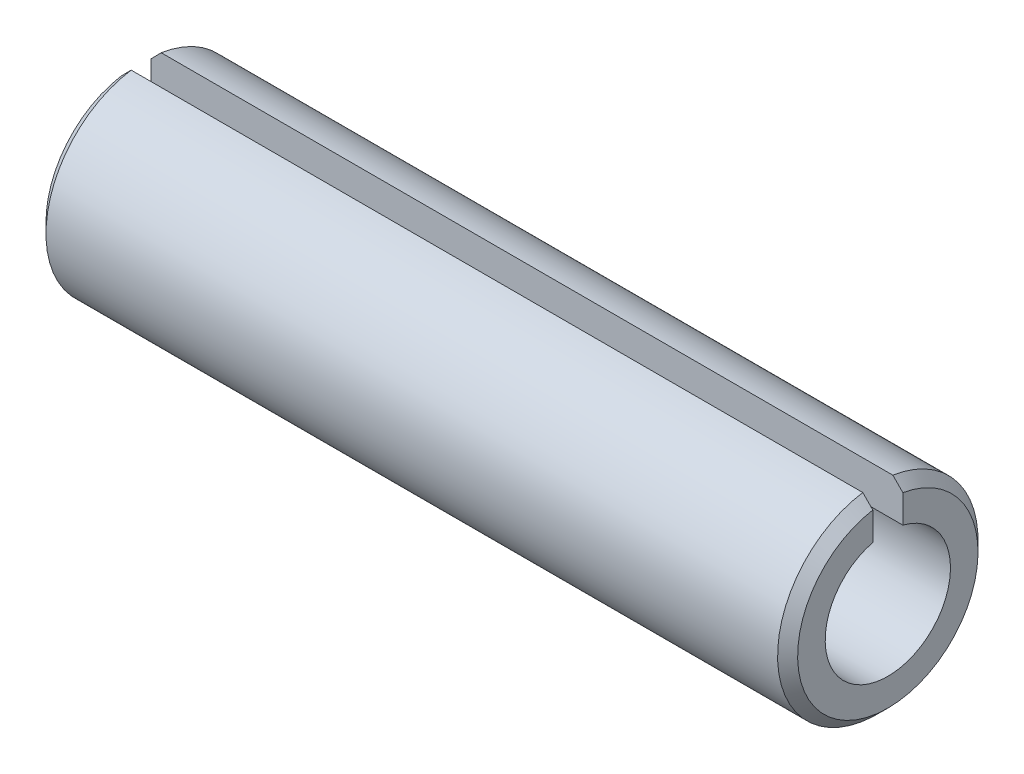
from build123d import *

# Parameters (mm, degrees)
ENL_V_MAT_EXTRU_2_DEPTH = 31.528675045


with BuildPart() as part:
    # Esquisse1 → Base-R_volution (revolve)
    with BuildSketch(Plane.XY, mode=Mode.PRIVATE) as base_r_volution_sk:
        Polygon((0, 2.5), (0, 3.6), (0.4, 4), (29.6, 4), (30, 3.6), (30, 2.5), align=None)
    revolve(base_r_volution_sk.sketch.rotate(Axis((0, 0, 0), (1, 0, 0)), 90), axis=Axis((0, 0, 0), (1, 0, 0)))

    # Esquisse2 → Enl_v. mat.-Extru.2 (cut, through all)
    with BuildSketch(Plane(origin=(0, 0, 0), x_dir=(0, 0, -1), z_dir=(1, 0, 0))):
        with BuildLine():
            Line((0.6, 3.954743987), (0.6, 2.42693222))
            ThreePointArc((0.6, 2.42693222), (0, 2.5), (-0.6, 2.42693222))
            Line((-0.6, 2.42693222), (-0.6, 3.954743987))
            ThreePointArc((-0.6, 3.954743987), (0, 4), (0.6, 3.954743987))
        make_face()
    extrude(amount=ENL_V_MAT_EXTRU_2_DEPTH, mode=Mode.SUBTRACT)


solid = part.part
